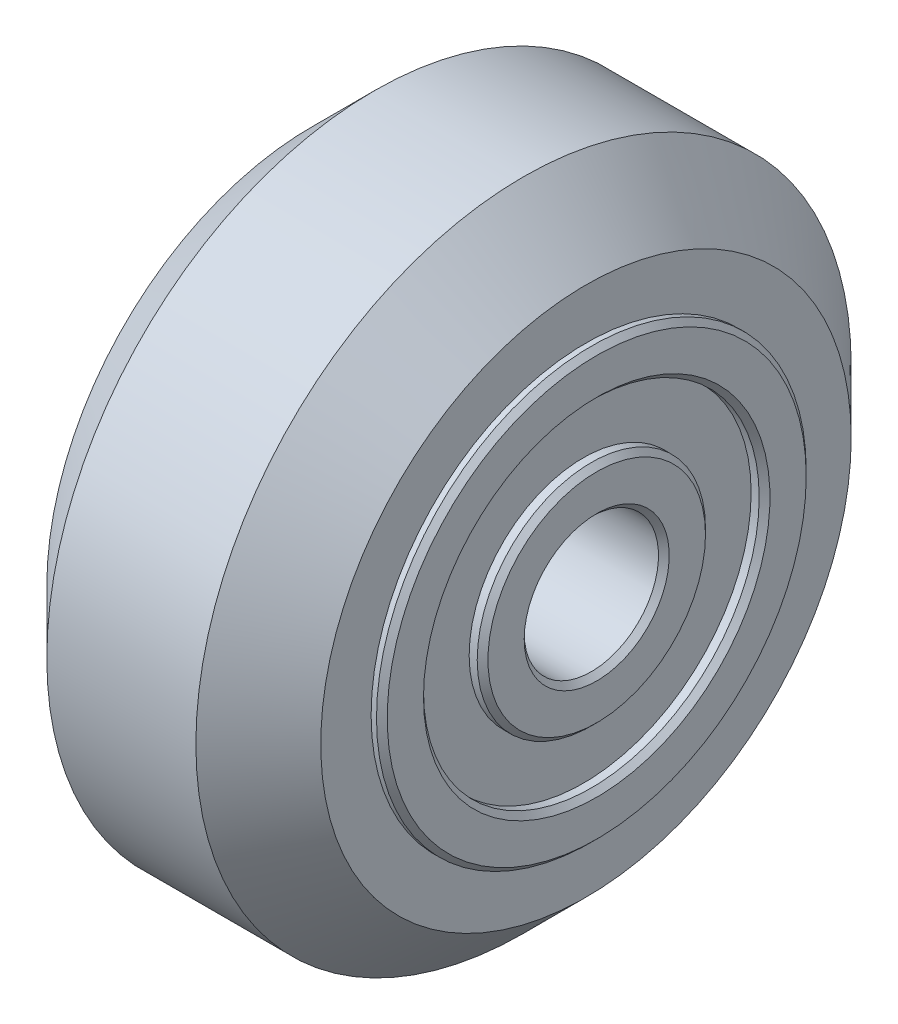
ISO-10303-21;
HEADER;
FILE_DESCRIPTION(('STEP AP214'),'2;1');
FILE_NAME('part.step','',(''),(''),'','','');
FILE_SCHEMA(('AUTOMOTIVE_DESIGN { 1 0 10303 214 1 1 1 1 }'));
ENDSEC;
DATA;
#1=APPLICATION_CONTEXT('core data for automotive mechanical design processes');
#2=APPLICATION_PROTOCOL_DEFINITION('international standard','automotive_design',2000,#1);
#3=PRODUCT_CONTEXT('',#1,'mechanical');
#4=PRODUCT('Part','Part','',(#3));
#5=PRODUCT_RELATED_PRODUCT_CATEGORY('part','',(#4));
#6=PRODUCT_DEFINITION_FORMATION('','',#4);
#7=PRODUCT_DEFINITION_CONTEXT('part definition',#1,'design');
#8=PRODUCT_DEFINITION('design','',#6,#7);
#9=PRODUCT_DEFINITION_SHAPE('','',#8);
#10=(LENGTH_UNIT() NAMED_UNIT(*) SI_UNIT(.MILLI.,.METRE.));
#11=(NAMED_UNIT(*) PLANE_ANGLE_UNIT() SI_UNIT($,.RADIAN.));
#12=(NAMED_UNIT(*) SI_UNIT($,.STERADIAN.) SOLID_ANGLE_UNIT());
#13=UNCERTAINTY_MEASURE_WITH_UNIT(LENGTH_MEASURE(1.E-05),#10,'distance_accuracy_value','');
#14=(GEOMETRIC_REPRESENTATION_CONTEXT(3) GLOBAL_UNCERTAINTY_ASSIGNED_CONTEXT((#13)) GLOBAL_UNIT_ASSIGNED_CONTEXT((#10,
#11,#12)) REPRESENTATION_CONTEXT('',''));
#15=CARTESIAN_POINT('',(0.,0.,0.));
#16=DIRECTION('',(0.,0.,1.));
#17=DIRECTION('',(1.,0.,0.));
#18=AXIS2_PLACEMENT_3D('',#15,#16,#17);
#19=CARTESIAN_POINT('',(5.5,2.5,0.));
#20=DIRECTION('',(1.,0.,0.));
#21=DIRECTION('',(0.,1.,0.));
#22=AXIS2_PLACEMENT_3D('',#19,#20,#21);
#23=PLANE('',#22);
#24=CARTESIAN_POINT('',(5.5,0.,0.));
#25=DIRECTION('',(-1.,0.,0.));
#26=DIRECTION('',(0.,0.,-1.));
#27=AXIS2_PLACEMENT_3D('',#24,#25,#26);
#28=CIRCLE('',#27,2.7);
#29=CARTESIAN_POINT('',(5.5,0.,2.7));
#30=VERTEX_POINT('',#29);
#31=EDGE_CURVE('P0_E198',#30,#30,#28,.T.);
#32=ORIENTED_EDGE('',*,*,#31,.T.);
#33=EDGE_LOOP('',(#32));
#34=FACE_BOUND('',#33,.T.);
#35=CARTESIAN_POINT('',(5.5,0.,0.));
#36=DIRECTION('',(1.,0.,0.));
#37=DIRECTION('',(0.,0.,-1.));
#38=AXIS2_PLACEMENT_3D('',#35,#36,#37);
#39=CIRCLE('',#38,4.05);
#40=CARTESIAN_POINT('',(5.5,0.,-4.05));
#41=VERTEX_POINT('',#40);
#42=EDGE_CURVE('P0_E162',#41,#41,#39,.T.);
#43=ORIENTED_EDGE('',*,*,#42,.T.);
#44=EDGE_LOOP('',(#43));
#45=FACE_BOUND('',#44,.T.);
#46=ADVANCED_FACE('P0_F17',(#34,#45),#23,.T.);
#47=CARTESIAN_POINT('',(5.,4.25,0.));
#48=DIRECTION('',(1.,0.,0.));
#49=DIRECTION('',(0.,1.,0.));
#50=AXIS2_PLACEMENT_3D('',#47,#48,#49);
#51=PLANE('',#50);
#52=CARTESIAN_POINT('',(5.,0.,0.));
#53=DIRECTION('',(1.,0.,0.));
#54=DIRECTION('',(0.,0.,-1.));
#55=AXIS2_PLACEMENT_3D('',#52,#53,#54);
#56=CIRCLE('',#55,4.25);
#57=CARTESIAN_POINT('',(5.,0.,4.25));
#58=VERTEX_POINT('',#57);
#59=EDGE_CURVE('P0_E262',#58,#58,#56,.T.);
#60=ORIENTED_EDGE('',*,*,#59,.F.);
#61=EDGE_LOOP('',(#60));
#62=FACE_BOUND('',#61,.T.);
#63=CARTESIAN_POINT('',(5.,0.,0.));
#64=DIRECTION('',(1.,0.,0.));
#65=DIRECTION('',(0.,0.,-1.));
#66=AXIS2_PLACEMENT_3D('',#63,#64,#65);
#67=CIRCLE('',#66,6.25);
#68=CARTESIAN_POINT('',(5.,0.,6.25));
#69=VERTEX_POINT('',#68);
#70=EDGE_CURVE('P0_E265',#69,#69,#67,.T.);
#71=ORIENTED_EDGE('',*,*,#70,.T.);
#72=EDGE_LOOP('',(#71));
#73=FACE_BOUND('',#72,.T.);
#74=ADVANCED_FACE('P0_F300',(#62,#73),#51,.T.);
#75=CARTESIAN_POINT('',(5.5,6.25,0.));
#76=DIRECTION('',(1.,0.,0.));
#77=DIRECTION('',(0.,1.,0.));
#78=AXIS2_PLACEMENT_3D('',#75,#76,#77);
#79=PLANE('',#78);
#80=CARTESIAN_POINT('',(5.5,0.,0.));
#81=DIRECTION('',(-1.,0.,0.));
#82=DIRECTION('',(0.,0.,-1.));
#83=AXIS2_PLACEMENT_3D('',#80,#81,#82);
#84=CIRCLE('',#83,6.45);
#85=CARTESIAN_POINT('',(5.5,0.,6.45));
#86=VERTEX_POINT('',#85);
#87=EDGE_CURVE('P0_E176',#86,#86,#84,.T.);
#88=ORIENTED_EDGE('',*,*,#87,.T.);
#89=EDGE_LOOP('',(#88));
#90=FACE_BOUND('',#89,.T.);
#91=CARTESIAN_POINT('',(5.5,0.,0.));
#92=DIRECTION('',(1.,0.,0.));
#93=DIRECTION('',(0.,0.,-1.));
#94=AXIS2_PLACEMENT_3D('',#91,#92,#93);
#95=CIRCLE('',#94,7.8);
#96=CARTESIAN_POINT('',(5.5,0.,-7.8));
#97=VERTEX_POINT('',#96);
#98=EDGE_CURVE('P0_E171',#97,#97,#95,.T.);
#99=ORIENTED_EDGE('',*,*,#98,.T.);
#100=EDGE_LOOP('',(#99));
#101=FACE_BOUND('',#100,.T.);
#102=ADVANCED_FACE('P0_F305',(#90,#101),#79,.T.);
#103=CARTESIAN_POINT('',(-5.5,6.25,0.));
#104=DIRECTION('',(-1.,0.,0.));
#105=DIRECTION('',(0.,0.,1.));
#106=AXIS2_PLACEMENT_3D('',#103,#104,#105);
#107=PLANE('',#106);
#108=CARTESIAN_POINT('',(-5.5,0.,0.));
#109=DIRECTION('',(1.,0.,0.));
#110=DIRECTION('',(0.,0.,1.));
#111=AXIS2_PLACEMENT_3D('',#108,#109,#110);
#112=CIRCLE('',#111,6.45);
#113=CARTESIAN_POINT('',(-5.5,0.,-6.45));
#114=VERTEX_POINT('',#113);
#115=EDGE_CURVE('P0_E223',#114,#114,#112,.T.);
#116=ORIENTED_EDGE('',*,*,#115,.T.);
#117=EDGE_LOOP('',(#116));
#118=FACE_BOUND('',#117,.T.);
#119=CARTESIAN_POINT('',(-5.5,0.,0.));
#120=DIRECTION('',(-1.,0.,0.));
#121=DIRECTION('',(0.,0.,1.));
#122=AXIS2_PLACEMENT_3D('',#119,#120,#121);
#123=CIRCLE('',#122,7.8);
#124=CARTESIAN_POINT('',(-5.5,0.,7.8));
#125=VERTEX_POINT('',#124);
#126=EDGE_CURVE('P0_E232',#125,#125,#123,.T.);
#127=ORIENTED_EDGE('',*,*,#126,.T.);
#128=EDGE_LOOP('',(#127));
#129=FACE_BOUND('',#128,.T.);
#130=ADVANCED_FACE('P0_F296',(#118,#129),#107,.T.);
#131=CARTESIAN_POINT('',(-5.,4.25,0.));
#132=DIRECTION('',(-1.,0.,0.));
#133=DIRECTION('',(0.,0.,1.));
#134=AXIS2_PLACEMENT_3D('',#131,#132,#133);
#135=PLANE('',#134);
#136=CARTESIAN_POINT('',(-5.,0.,0.));
#137=DIRECTION('',(1.,0.,0.));
#138=DIRECTION('',(0.,0.,-1.));
#139=AXIS2_PLACEMENT_3D('',#136,#137,#138);
#140=CIRCLE('',#139,4.25);
#141=CARTESIAN_POINT('',(-5.,0.,4.25));
#142=VERTEX_POINT('',#141);
#143=EDGE_CURVE('P0_E25',#142,#142,#140,.T.);
#144=ORIENTED_EDGE('',*,*,#143,.T.);
#145=EDGE_LOOP('',(#144));
#146=FACE_BOUND('',#145,.T.);
#147=CARTESIAN_POINT('',(-5.,0.,0.));
#148=DIRECTION('',(1.,0.,0.));
#149=DIRECTION('',(0.,0.,-1.));
#150=AXIS2_PLACEMENT_3D('',#147,#148,#149);
#151=CIRCLE('',#150,6.25);
#152=CARTESIAN_POINT('',(-5.,0.,6.25));
#153=VERTEX_POINT('',#152);
#154=EDGE_CURVE('P0_E45',#153,#153,#151,.T.);
#155=ORIENTED_EDGE('',*,*,#154,.F.);
#156=EDGE_LOOP('',(#155));
#157=FACE_BOUND('',#156,.T.);
#158=ADVANCED_FACE('P0_F276',(#146,#157),#135,.T.);
#159=CARTESIAN_POINT('',(-5.5,2.5,0.));
#160=DIRECTION('',(-1.,0.,0.));
#161=DIRECTION('',(0.,0.,1.));
#162=AXIS2_PLACEMENT_3D('',#159,#160,#161);
#163=PLANE('',#162);
#164=CARTESIAN_POINT('',(-5.5,0.,0.));
#165=DIRECTION('',(1.,0.,0.));
#166=DIRECTION('',(0.,0.,1.));
#167=AXIS2_PLACEMENT_3D('',#164,#165,#166);
#168=CIRCLE('',#167,2.7);
#169=CARTESIAN_POINT('',(-5.5,0.,-2.7));
#170=VERTEX_POINT('',#169);
#171=EDGE_CURVE('P0_E247',#170,#170,#168,.T.);
#172=ORIENTED_EDGE('',*,*,#171,.T.);
#173=EDGE_LOOP('',(#172));
#174=FACE_BOUND('',#173,.T.);
#175=CARTESIAN_POINT('',(-5.5,0.,0.));
#176=DIRECTION('',(-1.,0.,0.));
#177=DIRECTION('',(0.,0.,1.));
#178=AXIS2_PLACEMENT_3D('',#175,#176,#177);
#179=CIRCLE('',#178,4.05);
#180=CARTESIAN_POINT('',(-5.5,0.,4.05));
#181=VERTEX_POINT('',#180);
#182=EDGE_CURVE('P0_E206',#181,#181,#179,.T.);
#183=ORIENTED_EDGE('',*,*,#182,.T.);
#184=EDGE_LOOP('',(#183));
#185=FACE_BOUND('',#184,.T.);
#186=ADVANCED_FACE('P0_F285',(#174,#185),#163,.T.);
#187=CARTESIAN_POINT('',(0.,0.,0.));
#188=DIRECTION('',(1.,0.,0.));
#189=DIRECTION('',(0.,0.,-1.));
#190=AXIS2_PLACEMENT_3D('',#187,#188,#189);
#191=CYLINDRICAL_SURFACE('',#190,4.25);
#192=ORIENTED_EDGE('',*,*,#143,.F.);
#193=DIRECTION('',(-1.,0.,0.));
#194=VECTOR('',#193,1.);
#195=CARTESIAN_POINT('',(0.,0.,4.25));
#196=LINE('',#195,#194);
#197=CARTESIAN_POINT('',(-5.3,0.,4.25));
#198=VERTEX_POINT('',#197);
#199=EDGE_CURVE('P0_E11',#142,#198,#196,.T.);
#200=ORIENTED_EDGE('',*,*,#199,.T.);
#201=CARTESIAN_POINT('',(-5.3,0.,0.));
#202=DIRECTION('',(1.,0.,0.));
#203=DIRECTION('',(0.,0.,1.));
#204=AXIS2_PLACEMENT_3D('',#201,#202,#203);
#205=CIRCLE('',#204,4.25);
#206=EDGE_CURVE('P0_E250',#198,#198,#205,.T.);
#207=ORIENTED_EDGE('',*,*,#206,.T.);
#208=ORIENTED_EDGE('',*,*,#199,.F.);
#209=EDGE_LOOP('',(#192,#200,#207,#208));
#210=FACE_BOUND('',#209,.T.);
#211=ADVANCED_FACE('P0_F278',(#210),#191,.T.);
#212=CARTESIAN_POINT('',(0.,0.,0.));
#213=DIRECTION('',(1.,0.,0.));
#214=DIRECTION('',(0.,0.,-1.));
#215=AXIS2_PLACEMENT_3D('',#212,#213,#214);
#216=CYLINDRICAL_SURFACE('',#215,6.25);
#217=CARTESIAN_POINT('',(-5.3,0.,0.));
#218=DIRECTION('',(-1.,0.,0.));
#219=DIRECTION('',(0.,0.,1.));
#220=AXIS2_PLACEMENT_3D('',#217,#218,#219);
#221=CIRCLE('',#220,6.25);
#222=CARTESIAN_POINT('',(-5.3,0.,6.25));
#223=VERTEX_POINT('',#222);
#224=CARTESIAN_POINT('',(-5.3,0.,-6.25));
#225=VERTEX_POINT('',#224);
#226=EDGE_CURVE('P0_E209',#223,#225,#221,.T.);
#227=ORIENTED_EDGE('',*,*,#226,.T.);
#228=CARTESIAN_POINT('',(-5.3,0.,0.));
#229=DIRECTION('',(-1.,0.,0.));
#230=DIRECTION('',(0.,0.,1.));
#231=AXIS2_PLACEMENT_3D('',#228,#229,#230);
#232=CIRCLE('',#231,6.25);
#233=EDGE_CURVE('P0_E213',#225,#223,#232,.T.);
#234=ORIENTED_EDGE('',*,*,#233,.T.);
#235=DIRECTION('',(1.,0.,0.));
#236=VECTOR('',#235,1.);
#237=CARTESIAN_POINT('',(0.,0.,6.25));
#238=LINE('',#237,#236);
#239=EDGE_CURVE('P0_E144',#223,#153,#238,.T.);
#240=ORIENTED_EDGE('',*,*,#239,.T.);
#241=ORIENTED_EDGE('',*,*,#154,.T.);
#242=ORIENTED_EDGE('',*,*,#239,.F.);
#243=EDGE_LOOP('',(#227,#234,#240,#241,#242));
#244=FACE_BOUND('',#243,.T.);
#245=ADVANCED_FACE('P0_F294',(#244),#216,.F.);
#246=CARTESIAN_POINT('',(0.,0.,0.));
#247=DIRECTION('',(1.,0.,0.));
#248=DIRECTION('',(0.,0.,-1.));
#249=AXIS2_PLACEMENT_3D('',#246,#247,#248);
#250=CYLINDRICAL_SURFACE('',#249,8.);
#251=CARTESIAN_POINT('',(5.3,0.,0.));
#252=DIRECTION('',(-1.,0.,0.));
#253=DIRECTION('',(0.,0.,-1.));
#254=AXIS2_PLACEMENT_3D('',#251,#252,#253);
#255=CIRCLE('',#254,8.);
#256=CARTESIAN_POINT('',(5.3,0.,8.));
#257=VERTEX_POINT('',#256);
#258=CARTESIAN_POINT('',(5.3,0.,-8.));
#259=VERTEX_POINT('',#258);
#260=EDGE_CURVE('P0_E139',#257,#259,#255,.T.);
#261=ORIENTED_EDGE('',*,*,#260,.T.);
#262=CARTESIAN_POINT('',(5.3,0.,0.));
#263=DIRECTION('',(-1.,0.,0.));
#264=DIRECTION('',(0.,0.,-1.));
#265=AXIS2_PLACEMENT_3D('',#262,#263,#264);
#266=CIRCLE('',#265,8.);
#267=EDGE_CURVE('P0_E148',#259,#257,#266,.T.);
#268=ORIENTED_EDGE('',*,*,#267,.T.);
#269=DIRECTION('',(-1.,0.,0.));
#270=VECTOR('',#269,1.);
#271=CARTESIAN_POINT('',(0.,0.,8.));
#272=LINE('',#271,#270);
#273=CARTESIAN_POINT('',(-5.3,0.,8.));
#274=VERTEX_POINT('',#273);
#275=EDGE_CURVE('P0_E135',#257,#274,#272,.T.);
#276=ORIENTED_EDGE('',*,*,#275,.T.);
#277=CARTESIAN_POINT('',(-5.3,0.,0.));
#278=DIRECTION('',(1.,0.,0.));
#279=DIRECTION('',(0.,0.,1.));
#280=AXIS2_PLACEMENT_3D('',#277,#278,#279);
#281=CIRCLE('',#280,8.);
#282=EDGE_CURVE('P0_E141',#274,#274,#281,.T.);
#283=ORIENTED_EDGE('',*,*,#282,.T.);
#284=ORIENTED_EDGE('',*,*,#275,.F.);
#285=EDGE_LOOP('',(#261,#268,#276,#283,#284));
#286=FACE_BOUND('',#285,.T.);
#287=ADVANCED_FACE('P0_F137',(#286),#250,.T.);
#288=CARTESIAN_POINT('',(0.,0.,0.));
#289=DIRECTION('',(1.,0.,0.));
#290=DIRECTION('',(0.,0.,-1.));
#291=AXIS2_PLACEMENT_3D('',#288,#289,#290);
#292=CYLINDRICAL_SURFACE('',#291,6.25);
#293=ORIENTED_EDGE('',*,*,#70,.F.);
#294=DIRECTION('',(1.,0.,0.));
#295=VECTOR('',#294,1.);
#296=CARTESIAN_POINT('',(0.,0.,6.25));
#297=LINE('',#296,#295);
#298=CARTESIAN_POINT('',(5.3,0.,6.25));
#299=VERTEX_POINT('',#298);
#300=EDGE_CURVE('P0_E145',#69,#299,#297,.T.);
#301=ORIENTED_EDGE('',*,*,#300,.T.);
#302=CARTESIAN_POINT('',(5.3,0.,0.));
#303=DIRECTION('',(1.,0.,0.));
#304=DIRECTION('',(0.,0.,-1.));
#305=AXIS2_PLACEMENT_3D('',#302,#303,#304);
#306=CIRCLE('',#305,6.25);
#307=EDGE_CURVE('P0_E167',#299,#299,#306,.T.);
#308=ORIENTED_EDGE('',*,*,#307,.T.);
#309=ORIENTED_EDGE('',*,*,#300,.F.);
#310=EDGE_LOOP('',(#293,#301,#308,#309));
#311=FACE_BOUND('',#310,.T.);
#312=ADVANCED_FACE('P0_F320',(#311),#292,.F.);
#313=CARTESIAN_POINT('',(0.,0.,0.));
#314=DIRECTION('',(1.,0.,0.));
#315=DIRECTION('',(0.,0.,-1.));
#316=AXIS2_PLACEMENT_3D('',#313,#314,#315);
#317=CYLINDRICAL_SURFACE('',#316,4.25);
#318=CARTESIAN_POINT('',(5.3,0.,0.));
#319=DIRECTION('',(-1.,0.,0.));
#320=DIRECTION('',(0.,0.,-1.));
#321=AXIS2_PLACEMENT_3D('',#318,#319,#320);
#322=CIRCLE('',#321,4.25);
#323=CARTESIAN_POINT('',(5.3,0.,4.25));
#324=VERTEX_POINT('',#323);
#325=CARTESIAN_POINT('',(5.3,0.,-4.25));
#326=VERTEX_POINT('',#325);
#327=EDGE_CURVE('P0_E187',#324,#326,#322,.T.);
#328=ORIENTED_EDGE('',*,*,#327,.T.);
#329=CARTESIAN_POINT('',(5.3,0.,0.));
#330=DIRECTION('',(-1.,0.,0.));
#331=DIRECTION('',(0.,0.,-1.));
#332=AXIS2_PLACEMENT_3D('',#329,#330,#331);
#333=CIRCLE('',#332,4.25);
#334=EDGE_CURVE('P0_E182',#326,#324,#333,.T.);
#335=ORIENTED_EDGE('',*,*,#334,.T.);
#336=DIRECTION('',(-1.,0.,0.));
#337=VECTOR('',#336,1.);
#338=CARTESIAN_POINT('',(0.,0.,4.25));
#339=LINE('',#338,#337);
#340=EDGE_CURVE('P0_E205',#324,#58,#339,.T.);
#341=ORIENTED_EDGE('',*,*,#340,.T.);
#342=ORIENTED_EDGE('',*,*,#59,.T.);
#343=ORIENTED_EDGE('',*,*,#340,.F.);
#344=EDGE_LOOP('',(#328,#335,#341,#342,#343));
#345=FACE_BOUND('',#344,.T.);
#346=ADVANCED_FACE('P0_F315',(#345),#317,.T.);
#347=CARTESIAN_POINT('',(0.,0.,0.));
#348=DIRECTION('',(1.,0.,0.));
#349=DIRECTION('',(0.,0.,-1.));
#350=AXIS2_PLACEMENT_3D('',#347,#348,#349);
#351=CYLINDRICAL_SURFACE('',#350,2.5);
#352=CARTESIAN_POINT('',(-5.3,0.,0.));
#353=DIRECTION('',(-1.,0.,0.));
#354=DIRECTION('',(0.,0.,1.));
#355=AXIS2_PLACEMENT_3D('',#352,#353,#354);
#356=CIRCLE('',#355,2.5);
#357=CARTESIAN_POINT('',(-5.3,0.,2.5));
#358=VERTEX_POINT('',#357);
#359=CARTESIAN_POINT('',(-5.3,0.,-2.5));
#360=VERTEX_POINT('',#359);
#361=EDGE_CURVE('P0_E235',#358,#360,#356,.T.);
#362=ORIENTED_EDGE('',*,*,#361,.T.);
#363=CARTESIAN_POINT('',(-5.3,0.,0.));
#364=DIRECTION('',(-1.,0.,0.));
#365=DIRECTION('',(0.,0.,1.));
#366=AXIS2_PLACEMENT_3D('',#363,#364,#365);
#367=CIRCLE('',#366,2.5);
#368=EDGE_CURVE('P0_E239',#360,#358,#367,.T.);
#369=ORIENTED_EDGE('',*,*,#368,.T.);
#370=DIRECTION('',(1.,0.,0.));
#371=VECTOR('',#370,1.);
#372=CARTESIAN_POINT('',(0.,0.,2.5));
#373=LINE('',#372,#371);
#374=CARTESIAN_POINT('',(5.3,0.,2.5));
#375=VERTEX_POINT('',#374);
#376=EDGE_CURVE('P0_E202',#358,#375,#373,.T.);
#377=ORIENTED_EDGE('',*,*,#376,.T.);
#378=CARTESIAN_POINT('',(5.3,0.,0.));
#379=DIRECTION('',(1.,0.,0.));
#380=DIRECTION('',(0.,0.,-1.));
#381=AXIS2_PLACEMENT_3D('',#378,#379,#380);
#382=CIRCLE('',#381,2.5);
#383=EDGE_CURVE('P0_E165',#375,#375,#382,.T.);
#384=ORIENTED_EDGE('',*,*,#383,.T.);
#385=ORIENTED_EDGE('',*,*,#376,.F.);
#386=EDGE_LOOP('',(#362,#369,#377,#384,#385));
#387=FACE_BOUND('',#386,.T.);
#388=ADVANCED_FACE('P0_F362',(#387),#351,.F.);
#389=CARTESIAN_POINT('',(-5.3,0.,0.));
#390=DIRECTION('',(1.,0.,0.));
#391=DIRECTION('',(0.,0.,-1.));
#392=AXIS2_PLACEMENT_3D('',#389,#390,#391);
#393=CONICAL_SURFACE('',#392,4.25,0.785398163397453);
#394=ORIENTED_EDGE('',*,*,#206,.F.);
#395=DIRECTION('',(-0.707106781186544,0.,-0.707106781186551));
#396=VECTOR('',#395,1.);
#397=CARTESIAN_POINT('',(-5.3,0.,4.25));
#398=LINE('',#397,#396);
#399=EDGE_CURVE('P0_E253',#198,#181,#398,.T.);
#400=ORIENTED_EDGE('',*,*,#399,.T.);
#401=ORIENTED_EDGE('',*,*,#182,.F.);
#402=ORIENTED_EDGE('',*,*,#399,.F.);
#403=EDGE_LOOP('',(#394,#400,#401,#402));
#404=FACE_BOUND('',#403,.T.);
#405=ADVANCED_FACE('P0_F283',(#404),#393,.T.);
#406=CARTESIAN_POINT('',(-5.5,0.,0.));
#407=DIRECTION('',(-1.,0.,0.));
#408=DIRECTION('',(0.,0.,1.));
#409=AXIS2_PLACEMENT_3D('',#406,#407,#408);
#410=CONICAL_SURFACE('',#409,2.7,0.785398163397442);
#411=ORIENTED_EDGE('',*,*,#361,.F.);
#412=ORIENTED_EDGE('',*,*,#368,.F.);
#413=DIRECTION('',(-0.707106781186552,0.,-0.707106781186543));
#414=VECTOR('',#413,1.);
#415=CARTESIAN_POINT('',(-5.5,0.,-2.7));
#416=LINE('',#415,#414);
#417=EDGE_CURVE('P0_E243',#360,#170,#416,.T.);
#418=ORIENTED_EDGE('',*,*,#417,.T.);
#419=ORIENTED_EDGE('',*,*,#171,.F.);
#420=ORIENTED_EDGE('',*,*,#417,.F.);
#421=EDGE_LOOP('',(#411,#412,#418,#419,#420));
#422=FACE_BOUND('',#421,.T.);
#423=ADVANCED_FACE('P0_F344',(#422),#410,.F.);
#424=CARTESIAN_POINT('',(-5.3,0.,0.));
#425=DIRECTION('',(1.,0.,0.));
#426=DIRECTION('',(0.,0.,-1.));
#427=AXIS2_PLACEMENT_3D('',#424,#425,#426);
#428=CONICAL_SURFACE('',#427,8.,0.785398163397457);
#429=ORIENTED_EDGE('',*,*,#282,.F.);
#430=DIRECTION('',(-0.707106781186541,0.,-0.707106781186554));
#431=VECTOR('',#430,1.);
#432=CARTESIAN_POINT('',(-5.3,0.,8.));
#433=LINE('',#432,#431);
#434=EDGE_CURVE('P0_E228',#274,#125,#433,.T.);
#435=ORIENTED_EDGE('',*,*,#434,.T.);
#436=ORIENTED_EDGE('',*,*,#126,.F.);
#437=ORIENTED_EDGE('',*,*,#434,.F.);
#438=EDGE_LOOP('',(#429,#435,#436,#437));
#439=FACE_BOUND('',#438,.T.);
#440=ADVANCED_FACE('P0_F341',(#439),#428,.T.);
#441=CARTESIAN_POINT('',(-5.5,0.,0.));
#442=DIRECTION('',(-1.,0.,0.));
#443=DIRECTION('',(0.,0.,1.));
#444=AXIS2_PLACEMENT_3D('',#441,#442,#443);
#445=CONICAL_SURFACE('',#444,6.45,0.785398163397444);
#446=ORIENTED_EDGE('',*,*,#226,.F.);
#447=ORIENTED_EDGE('',*,*,#233,.F.);
#448=DIRECTION('',(-0.707106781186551,0.,-0.707106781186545));
#449=VECTOR('',#448,1.);
#450=CARTESIAN_POINT('',(-5.5,0.,-6.45));
#451=LINE('',#450,#449);
#452=EDGE_CURVE('P0_E219',#225,#114,#451,.T.);
#453=ORIENTED_EDGE('',*,*,#452,.T.);
#454=ORIENTED_EDGE('',*,*,#115,.F.);
#455=ORIENTED_EDGE('',*,*,#452,.F.);
#456=EDGE_LOOP('',(#446,#447,#453,#454,#455));
#457=FACE_BOUND('',#456,.T.);
#458=ADVANCED_FACE('P0_F343',(#457),#445,.F.);
#459=CARTESIAN_POINT('',(5.3,0.,0.));
#460=DIRECTION('',(1.,0.,0.));
#461=DIRECTION('',(0.,0.,-1.));
#462=AXIS2_PLACEMENT_3D('',#459,#460,#461);
#463=CONICAL_SURFACE('',#462,2.5,0.78539816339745);
#464=ORIENTED_EDGE('',*,*,#383,.F.);
#465=DIRECTION('',(0.707106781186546,0.,0.707106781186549));
#466=VECTOR('',#465,1.);
#467=CARTESIAN_POINT('',(5.3,0.,2.5));
#468=LINE('',#467,#466);
#469=EDGE_CURVE('P0_E191',#375,#30,#468,.T.);
#470=ORIENTED_EDGE('',*,*,#469,.T.);
#471=ORIENTED_EDGE('',*,*,#31,.F.);
#472=ORIENTED_EDGE('',*,*,#469,.F.);
#473=EDGE_LOOP('',(#464,#470,#471,#472));
#474=FACE_BOUND('',#473,.T.);
#475=ADVANCED_FACE('P0_F350',(#474),#463,.F.);
#476=CARTESIAN_POINT('',(5.5,0.,0.));
#477=DIRECTION('',(-1.,0.,0.));
#478=DIRECTION('',(0.,0.,1.));
#479=AXIS2_PLACEMENT_3D('',#476,#477,#478);
#480=CONICAL_SURFACE('',#479,4.05,0.785398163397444);
#481=ORIENTED_EDGE('',*,*,#327,.F.);
#482=ORIENTED_EDGE('',*,*,#334,.F.);
#483=DIRECTION('',(0.707106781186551,0.,0.707106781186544));
#484=VECTOR('',#483,1.);
#485=CARTESIAN_POINT('',(5.5,0.,-4.05));
#486=LINE('',#485,#484);
#487=EDGE_CURVE('P0_E166',#326,#41,#486,.T.);
#488=ORIENTED_EDGE('',*,*,#487,.T.);
#489=ORIENTED_EDGE('',*,*,#42,.F.);
#490=ORIENTED_EDGE('',*,*,#487,.F.);
#491=EDGE_LOOP('',(#481,#482,#488,#489,#490));
#492=FACE_BOUND('',#491,.T.);
#493=ADVANCED_FACE('P0_F312',(#492),#480,.T.);
#494=CARTESIAN_POINT('',(5.3,0.,0.));
#495=DIRECTION('',(1.,0.,0.));
#496=DIRECTION('',(0.,0.,-1.));
#497=AXIS2_PLACEMENT_3D('',#494,#495,#496);
#498=CONICAL_SURFACE('',#497,6.25,0.785398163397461);
#499=ORIENTED_EDGE('',*,*,#307,.F.);
#500=DIRECTION('',(0.707106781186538,0.,0.707106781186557));
#501=VECTOR('',#500,1.);
#502=CARTESIAN_POINT('',(5.3,0.,6.25));
#503=LINE('',#502,#501);
#504=EDGE_CURVE('P0_E170',#299,#86,#503,.T.);
#505=ORIENTED_EDGE('',*,*,#504,.T.);
#506=ORIENTED_EDGE('',*,*,#87,.F.);
#507=ORIENTED_EDGE('',*,*,#504,.F.);
#508=EDGE_LOOP('',(#499,#505,#506,#507));
#509=FACE_BOUND('',#508,.T.);
#510=ADVANCED_FACE('P0_F324',(#509),#498,.F.);
#511=CARTESIAN_POINT('',(5.5,0.,0.));
#512=DIRECTION('',(-1.,0.,0.));
#513=DIRECTION('',(0.,0.,1.));
#514=AXIS2_PLACEMENT_3D('',#511,#512,#513);
#515=CONICAL_SURFACE('',#514,7.8,0.785398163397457);
#516=ORIENTED_EDGE('',*,*,#260,.F.);
#517=ORIENTED_EDGE('',*,*,#267,.F.);
#518=DIRECTION('',(0.707106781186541,0.,0.707106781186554));
#519=VECTOR('',#518,1.);
#520=CARTESIAN_POINT('',(5.5,0.,-7.8));
#521=LINE('',#520,#519);
#522=EDGE_CURVE('P0_E152',#259,#97,#521,.T.);
#523=ORIENTED_EDGE('',*,*,#522,.T.);
#524=ORIENTED_EDGE('',*,*,#98,.F.);
#525=ORIENTED_EDGE('',*,*,#522,.F.);
#526=EDGE_LOOP('',(#516,#517,#523,#524,#525));
#527=FACE_BOUND('',#526,.T.);
#528=ADVANCED_FACE('P0_F154',(#527),#515,.T.);
#529=CLOSED_SHELL('',(#46,#74,#102,#130,#158,#186,#211,#245,#287,#312,#346,#388,#405,#423,#440,
#458,#475,#493,#510,#528));
#530=MANIFOLD_SOLID_BREP('P0_B1',#529);
#531=CARTESIAN_POINT('',(5.1,0.,0.));
#532=DIRECTION('',(1.,0.,0.));
#533=DIRECTION('',(0.,1.,0.));
#534=AXIS2_PLACEMENT_3D('',#531,#532,#533);
#535=PLANE('',#534);
#536=CARTESIAN_POINT('',(5.1,0.,0.));
#537=DIRECTION('',(-1.,0.,0.));
#538=DIRECTION('',(0.,0.,1.));
#539=AXIS2_PLACEMENT_3D('',#536,#537,#538);
#540=CIRCLE('',#539,8.);
#541=CARTESIAN_POINT('',(5.1,0.,-8.));
#542=VERTEX_POINT('',#541);
#543=EDGE_CURVE('P1_E96',#542,#542,#540,.T.);
#544=ORIENTED_EDGE('',*,*,#543,.T.);
#545=EDGE_LOOP('',(#544));
#546=FACE_BOUND('',#545,.T.);
#547=CARTESIAN_POINT('',(5.1,0.,0.));
#548=DIRECTION('',(-1.,0.,0.));
#549=DIRECTION('',(0.,0.,1.));
#550=AXIS2_PLACEMENT_3D('',#547,#548,#549);
#551=CIRCLE('',#550,9.875);
#552=CARTESIAN_POINT('',(5.1,0.,-9.875));
#553=VERTEX_POINT('',#552);
#554=EDGE_CURVE('P1_E93',#553,#553,#551,.T.);
#555=ORIENTED_EDGE('',*,*,#554,.F.);
#556=EDGE_LOOP('',(#555));
#557=FACE_BOUND('',#556,.T.);
#558=ADVANCED_FACE('P1_F17',(#546,#557),#535,.T.);
#559=CARTESIAN_POINT('',(-5.1,0.,0.));
#560=DIRECTION('',(1.,0.,0.));
#561=DIRECTION('',(0.,1.,0.));
#562=AXIS2_PLACEMENT_3D('',#559,#560,#561);
#563=PLANE('',#562);
#564=CARTESIAN_POINT('',(-5.1,0.,0.));
#565=DIRECTION('',(-1.,0.,0.));
#566=DIRECTION('',(0.,0.,1.));
#567=AXIS2_PLACEMENT_3D('',#564,#565,#566);
#568=CIRCLE('',#567,8.);
#569=CARTESIAN_POINT('',(-5.1,0.,-8.));
#570=VERTEX_POINT('',#569);
#571=EDGE_CURVE('P1_E42',#570,#570,#568,.T.);
#572=ORIENTED_EDGE('',*,*,#571,.F.);
#573=EDGE_LOOP('',(#572));
#574=FACE_BOUND('',#573,.T.);
#575=CARTESIAN_POINT('',(-5.1,0.,0.));
#576=DIRECTION('',(-1.,0.,0.));
#577=DIRECTION('',(0.,0.,1.));
#578=AXIS2_PLACEMENT_3D('',#575,#576,#577);
#579=CIRCLE('',#578,9.875);
#580=CARTESIAN_POINT('',(-5.1,0.,9.875));
#581=VERTEX_POINT('',#580);
#582=EDGE_CURVE('P1_E11',#581,#581,#579,.T.);
#583=ORIENTED_EDGE('',*,*,#582,.T.);
#584=EDGE_LOOP('',(#583));
#585=FACE_BOUND('',#584,.T.);
#586=ADVANCED_FACE('P1_F192',(#574,#585),#563,.F.);
#587=CARTESIAN_POINT('',(-5.1,0.,0.));
#588=DIRECTION('',(1.,0.,0.));
#589=DIRECTION('',(0.,0.,-1.));
#590=AXIS2_PLACEMENT_3D('',#587,#588,#589);
#591=CONICAL_SURFACE('',#590,9.875,0.78539816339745);
#592=CARTESIAN_POINT('',(-2.775,0.,0.));
#593=DIRECTION('',(-1.,0.,0.));
#594=DIRECTION('',(0.,0.,1.));
#595=AXIS2_PLACEMENT_3D('',#592,#593,#594);
#596=CIRCLE('',#595,12.2);
#597=CARTESIAN_POINT('',(-2.775,0.,-12.2));
#598=VERTEX_POINT('',#597);
#599=CARTESIAN_POINT('',(-2.775,0.,12.2));
#600=VERTEX_POINT('',#599);
#601=EDGE_CURVE('P1_E70',#598,#600,#596,.T.);
#602=ORIENTED_EDGE('',*,*,#601,.T.);
#603=DIRECTION('',(-0.707106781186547,0.,-0.707106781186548));
#604=VECTOR('',#603,1.);
#605=CARTESIAN_POINT('',(-5.1,0.,9.875));
#606=LINE('',#605,#604);
#607=EDGE_CURVE('P1_E25',#600,#581,#606,.T.);
#608=ORIENTED_EDGE('',*,*,#607,.T.);
#609=ORIENTED_EDGE('',*,*,#582,.F.);
#610=ORIENTED_EDGE('',*,*,#607,.F.);
#611=CARTESIAN_POINT('',(-2.775,0.,0.));
#612=DIRECTION('',(-1.,0.,0.));
#613=DIRECTION('',(0.,0.,1.));
#614=AXIS2_PLACEMENT_3D('',#611,#612,#613);
#615=CIRCLE('',#614,12.2);
#616=EDGE_CURVE('P1_E65',#600,#598,#615,.T.);
#617=ORIENTED_EDGE('',*,*,#616,.T.);
#618=EDGE_LOOP('',(#602,#608,#609,#610,#617));
#619=FACE_BOUND('',#618,.T.);
#620=ADVANCED_FACE('P1_F67',(#619),#591,.T.);
#621=CARTESIAN_POINT('',(0.,0.,0.));
#622=DIRECTION('',(-1.,0.,0.));
#623=DIRECTION('',(0.,0.,1.));
#624=AXIS2_PLACEMENT_3D('',#621,#622,#623);
#625=CYLINDRICAL_SURFACE('',#624,8.);
#626=ORIENTED_EDGE('',*,*,#543,.F.);
#627=DIRECTION('',(-1.,0.,0.));
#628=VECTOR('',#627,1.);
#629=CARTESIAN_POINT('',(0.,0.,-8.));
#630=LINE('',#629,#628);
#631=EDGE_CURVE('P1_E100',#542,#570,#630,.T.);
#632=ORIENTED_EDGE('',*,*,#631,.T.);
#633=ORIENTED_EDGE('',*,*,#571,.T.);
#634=ORIENTED_EDGE('',*,*,#631,.F.);
#635=EDGE_LOOP('',(#626,#632,#633,#634));
#636=FACE_BOUND('',#635,.T.);
#637=ADVANCED_FACE('P1_F172',(#636),#625,.F.);
#638=CARTESIAN_POINT('',(2.775,0.,0.));
#639=DIRECTION('',(-1.,0.,0.));
#640=DIRECTION('',(0.,0.,1.));
#641=AXIS2_PLACEMENT_3D('',#638,#639,#640);
#642=CONICAL_SURFACE('',#641,12.2,0.785398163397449);
#643=CARTESIAN_POINT('',(2.775,0.,0.));
#644=DIRECTION('',(-1.,0.,0.));
#645=DIRECTION('',(0.,0.,1.));
#646=AXIS2_PLACEMENT_3D('',#643,#644,#645);
#647=CIRCLE('',#646,12.2);
#648=CARTESIAN_POINT('',(2.775,0.,-12.2));
#649=VERTEX_POINT('',#648);
#650=EDGE_CURVE('P1_E74',#649,#649,#647,.T.);
#651=ORIENTED_EDGE('',*,*,#650,.F.);
#652=DIRECTION('',(0.707106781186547,0.,0.707106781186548));
#653=VECTOR('',#652,1.);
#654=CARTESIAN_POINT('',(2.775,0.,-12.2));
#655=LINE('',#654,#653);
#656=EDGE_CURVE('P1_E73',#649,#553,#655,.T.);
#657=ORIENTED_EDGE('',*,*,#656,.T.);
#658=ORIENTED_EDGE('',*,*,#554,.T.);
#659=ORIENTED_EDGE('',*,*,#656,.F.);
#660=EDGE_LOOP('',(#651,#657,#658,#659));
#661=FACE_BOUND('',#660,.T.);
#662=ADVANCED_FACE('P1_F161',(#661),#642,.T.);
#663=CARTESIAN_POINT('',(0.,0.,0.));
#664=DIRECTION('',(-1.,0.,0.));
#665=DIRECTION('',(0.,0.,1.));
#666=AXIS2_PLACEMENT_3D('',#663,#664,#665);
#667=CYLINDRICAL_SURFACE('',#666,12.2);
#668=ORIENTED_EDGE('',*,*,#601,.F.);
#669=DIRECTION('',(1.,0.,0.));
#670=VECTOR('',#669,1.);
#671=CARTESIAN_POINT('',(0.,0.,-12.2));
#672=LINE('',#671,#670);
#673=EDGE_CURVE('P1_E78',#598,#649,#672,.T.);
#674=ORIENTED_EDGE('',*,*,#673,.T.);
#675=ORIENTED_EDGE('',*,*,#650,.T.);
#676=ORIENTED_EDGE('',*,*,#673,.F.);
#677=ORIENTED_EDGE('',*,*,#616,.F.);
#678=EDGE_LOOP('',(#668,#674,#675,#676,#677));
#679=FACE_BOUND('',#678,.T.);
#680=ADVANCED_FACE('P1_F79',(#679),#667,.T.);
#681=CLOSED_SHELL('',(#558,#586,#620,#637,#662,#680));
#682=MANIFOLD_SOLID_BREP('P1_B1',#681);
#683=ADVANCED_BREP_SHAPE_REPRESENTATION('',(#18,#530,#682),#14);
#684=SHAPE_DEFINITION_REPRESENTATION(#9,#683);
ENDSEC;
END-ISO-10303-21;
